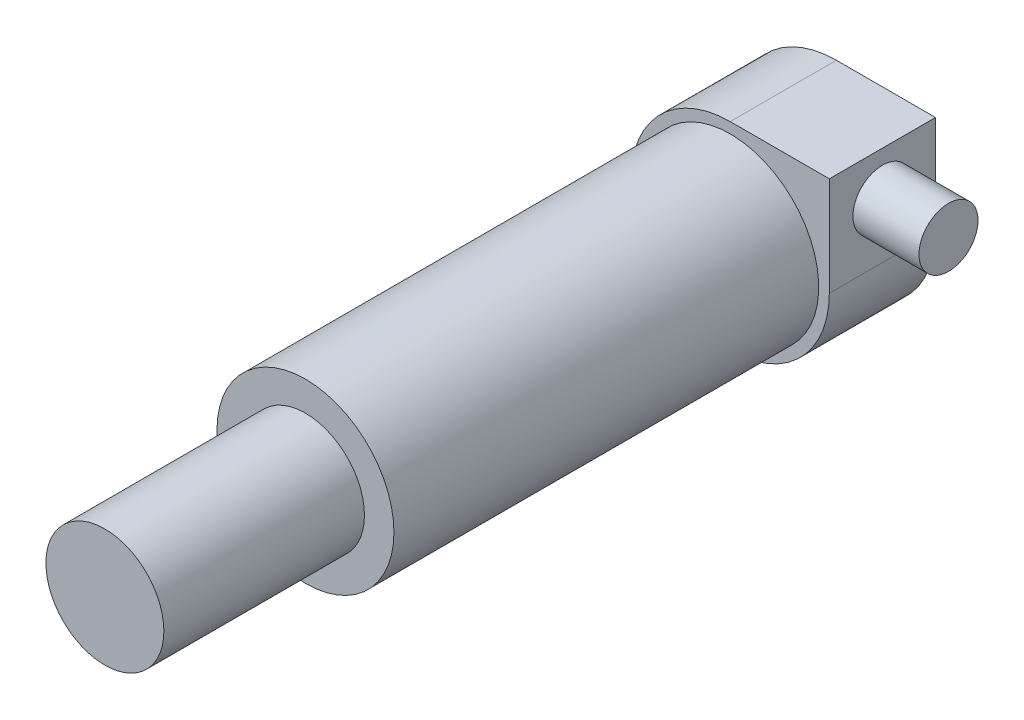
from build123d import *

# Parameters (mm, degrees)
SKETCH1_R          = 19.05
TI_TUBE_DEPTH      = 91.44
PUMP_HOUSING_DEPTH = 22.86
SKETCH3_R          = 6.35
HOSE_BARB1_DEPTH   = 14.224
SKETCH4_R          = 6.35
HOSE_BARB2_DEPTH   = 14.224
SKETCH5_R          = 12.7
UW_CONN_DEPTH      = 43.18


with BuildPart() as part:
    # Sketch1 → Ti_tube (new body)
    with BuildSketch(Plane.XY):
        with Locations(Location((0, 0, 0), (0, 0, 180))):
            Circle(SKETCH1_R)
    extrude(amount=TI_TUBE_DEPTH)

    # Sketch2 → pump_housing (add)
    with BuildSketch(Plane(origin=(0, 0, 0), x_dir=(-1, 0, 0), z_dir=(0, 0, -1))):
        with BuildLine():
            Line((0, 21.336), (-21.336, 21.336))
            Line((-21.336, 21.336), (-21.336, 0))
            ThreePointArc((-21.336, 0), (15.086830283, -15.086830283), (0, 21.336))
        make_face()
    extrude(amount=PUMP_HOUSING_DEPTH)

    # Sketch3 → hose_barb1 (add)
    with BuildSketch(Plane(origin=(21.336, 0, 0), x_dir=(0, 0, -1), z_dir=(1, 0, 0))):
        with Locations(Location((11.43, 11.811, 0), (0, 0, 180))):
            Circle(SKETCH3_R)
    extrude(amount=HOSE_BARB1_DEPTH)

    # Sketch4 → hose_barb2 (add)
    with BuildSketch(Plane(origin=(0, 0, -22.86), x_dir=(-1, 0, 0), z_dir=(0, 0, -1))):
        Circle(SKETCH4_R)
    extrude(amount=HOSE_BARB2_DEPTH)

    # Sketch5 → uw_conn (add)
    with BuildSketch(Plane.XY.offset(91.44)):
        Circle(SKETCH5_R)
    extrude(amount=UW_CONN_DEPTH)


solid = part.part
